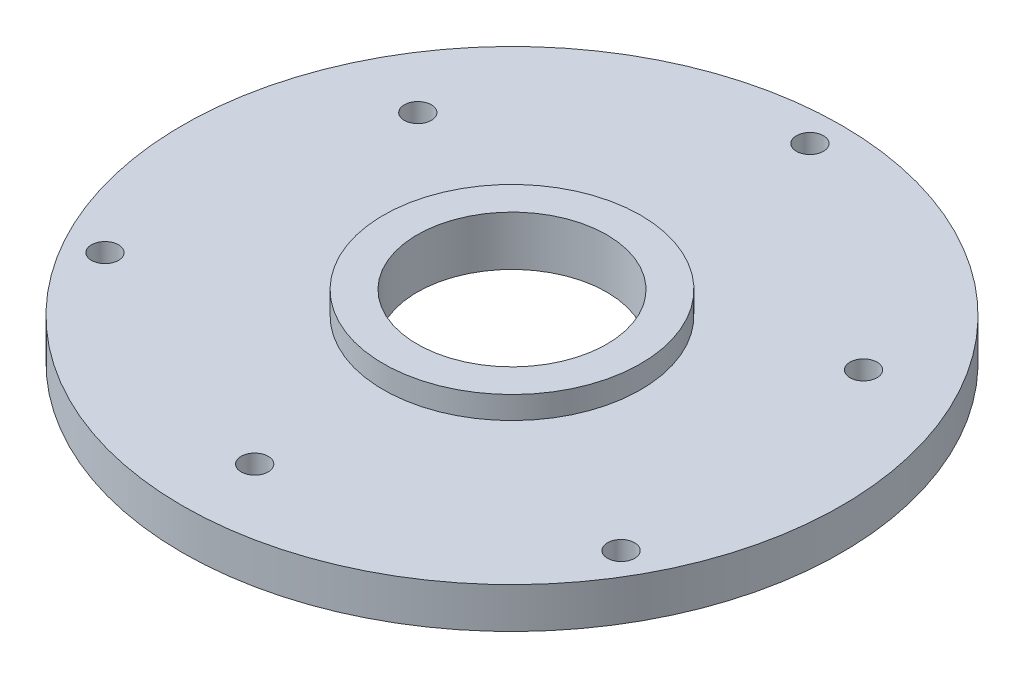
from build123d import *

# Parameters (mm, degrees)
SCHIZZO2_R               = 1.5
TAGLIO_ESTRUSIONE1_DEPTH = 52.81457324
SCHIZZO6_R               = 1.5
TAGLIO_ESTRUSIONE3_DEPTH = 53.091266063


with BuildPart() as part:
    # Schizzo1 → Rivoluzione1 (revolve)
    with BuildSketch(Plane.XY, mode=Mode.PRIVATE) as rivoluzione1_sk:
        Polygon((36.5, 38.885931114), (36.5, 34.385931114), (17.5, 34.385931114), (17.5, 35.885931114), (10.5, 35.885931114), (10.5, 41.385931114), (14.25, 41.385931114), (14.25, 38.885931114), align=None)
    revolve(rivoluzione1_sk.sketch.rotate(Axis((0, 0, 0), (0, 1, 0)), 90), axis=Axis((0, 0, 0), (0, 1, 0)))

    # Schizzo2 → Taglio-Estrusione1 (cut, through all)
    with BuildSketch(Plane(origin=(0, 38.885931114, 0), x_dir=(1, 0, 0), z_dir=(0, 1, 0))):
        with Locations(Location((0, 33, 0), (0, 0, 270))):
            Circle(SCHIZZO2_R)
        with Locations(Location((28.578838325, -16.5, 0), (0, 0, 270))):
            Circle(SCHIZZO2_R)
        with Locations(Location((-28.578838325, -16.5, 0), (0, 0, 270))):
            Circle(SCHIZZO2_R)
    extrude(amount=-TAGLIO_ESTRUSIONE1_DEPTH, mode=Mode.SUBTRACT)

    # Schizzo6 → Taglio-Estrusione3 (cut, through all)
    with BuildSketch(Plane(origin=(0, 34.385931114, 0), x_dir=(-1, 0, 0), z_dir=(0, -1, 0))):
        with Locations(Location((0, -28.5, 0), (0, 0, 90))):
            Circle(SCHIZZO6_R)
        with Locations(Location((-24.681724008, 14.25, 0), (0, 0, 90))):
            Circle(SCHIZZO6_R)
        with Locations(Location((24.681724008, 14.25, 0), (0, 0, 90))):
            Circle(SCHIZZO6_R)
    extrude(amount=-TAGLIO_ESTRUSIONE3_DEPTH, mode=Mode.SUBTRACT)


solid = part.part
